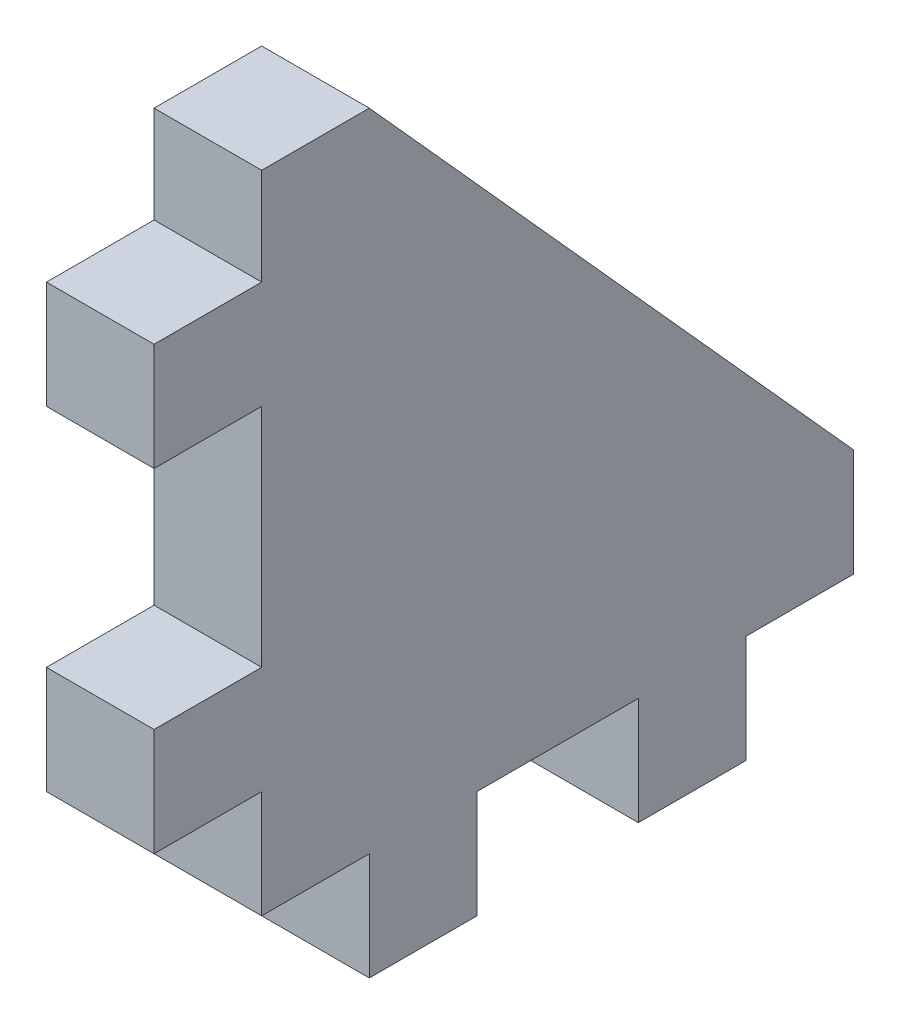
from build123d import *

# Parameters (mm, degrees)
ESTRUSIONE_ESTRUSIONE1_DEPTH = 20


with BuildPart() as part:
    # Schizzo1 → Estrusione-Estrusione1 (new body)
    with BuildSketch(Plane(origin=(0, 0, 0), x_dir=(0, 0, -1), z_dir=(1, 0, 0))):
        Polygon((0, 40), (0, 82), (-20, 82), (-20, 102), (0, 102), (0, 120), (20, 120), (110, 20), (110, 0), (90, 0), (90, -20), (70, -20), (70, 0), (40, 0), (40, -20), (20, -20), (20, 0), (0, 0), (0, 20), (-20, 20), (-20, 40), align=None)
    extrude(amount=ESTRUSIONE_ESTRUSIONE1_DEPTH)


solid = part.part
